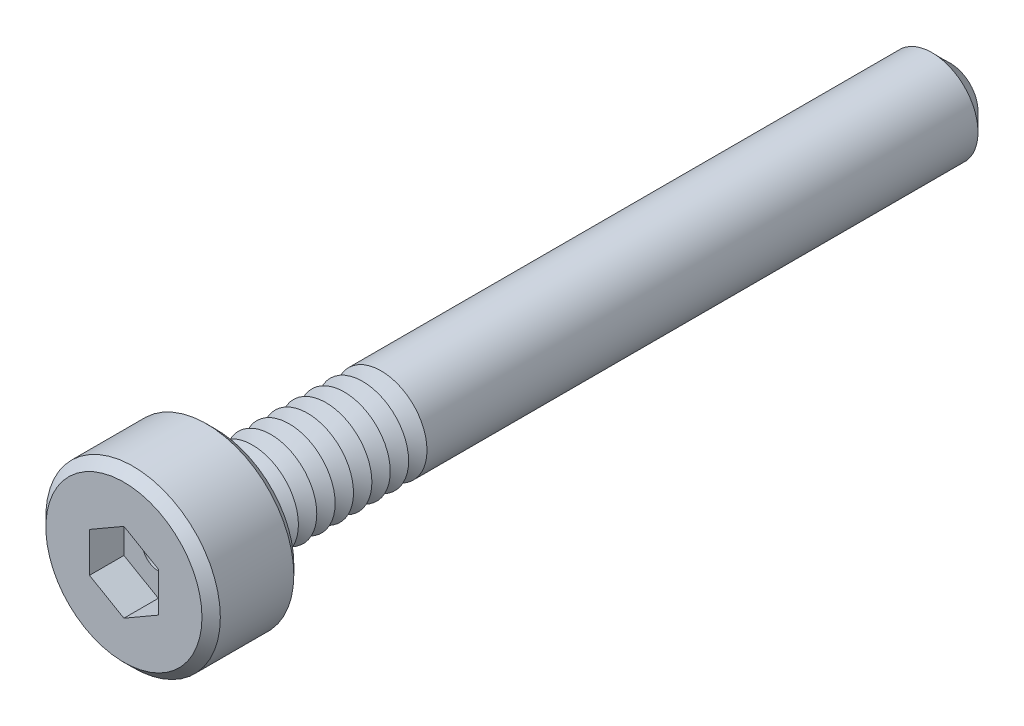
from build123d import *

# Parameters (mm, degrees)
SKETCH1_R           = 1.9
BOSS_EXTRUDE1_DEPTH = 2
SKETCH2_R           = 1
BOSS_EXTRUDE2_DEPTH = 16
CHAMFER1_SIZE       = 0.4
LPATTERN1_COUNT     = 9
LPATTERN1_PITCH     = 0.4
CUT_EXTRUDE1_DEPTH  = 0.75
SKETCH6_R           = 0.35
CUT_EXTRUDE2_DEPTH  = 17.25
CHAMFER2_SIZE       = 0.2


with BuildPart() as part:
    # Sketch1 → Boss-Extrude1 (new body)
    with BuildSketch(Plane.XY):
        Circle(SKETCH1_R)
    extrude(amount=BOSS_EXTRUDE1_DEPTH)

    # Sketch2 → Boss-Extrude2 (add)
    with BuildSketch(Plane(origin=(0, 0, 0), x_dir=(-1, 0, 0), z_dir=(0, 0, -1))):
        Circle(SKETCH2_R)
    extrude(amount=BOSS_EXTRUDE2_DEPTH)

    # Chamfer1
    chamfer1_edges = [part.edges().sort_by_distance(p)[0] for p in [
        (1, 0, -16),
    ]]
    chamfer(chamfer1_edges, length=CHAMFER1_SIZE)

    # Sketch4 → Cut-Revolve1 (revolve, cut)
    with BuildSketch(Plane(origin=(0, 0, 0), x_dir=(0, 0, -1), z_dir=(1, 0, 0)), mode=Mode.PRIVATE) as cut_revolve1_sk:
        Polygon((0, 1), (0.2, 0.653589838), (0.4, 1), align=None)
    cut_revolve1 = revolve(cut_revolve1_sk.sketch.rotate(Axis((0, 0, 2.512122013), (0, 0, -1)), 90), axis=Axis((0, 0, 2.512122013), (0, 0, -1)), mode=Mode.SUBTRACT)

    # LPattern1: Cut-Revolve1 ×9
    with Locations(*[(0, 0, -i * LPATTERN1_PITCH) for i in range(1, LPATTERN1_COUNT)]):
        add(cut_revolve1, mode=Mode.SUBTRACT)

    # Sketch5 → Cut-Extrude1 (cut)
    with BuildSketch(Plane.XY.offset(2)):
        Polygon((0, 0.866025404), (-0.75, 0.433012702), (-0.75, -0.433012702), (0, -0.866025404), (0.75, -0.433012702), (0.75, 0.433012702), align=None)
    extrude(amount=-CUT_EXTRUDE1_DEPTH, mode=Mode.SUBTRACT)

    # Sketch6 → Cut-Extrude2 (cut)
    with BuildSketch(Plane.XY.offset(1.25)):
        Circle(SKETCH6_R)
    extrude(amount=-CUT_EXTRUDE2_DEPTH, mode=Mode.SUBTRACT)

    # Chamfer2
    chamfer2_edges = [part.edges().sort_by_distance(p)[0] for p in [
        (-1.9, 0, 0),
        (-1.9, 0, 2),
    ]]
    chamfer(chamfer2_edges, length=CHAMFER2_SIZE)


solid = part.part
